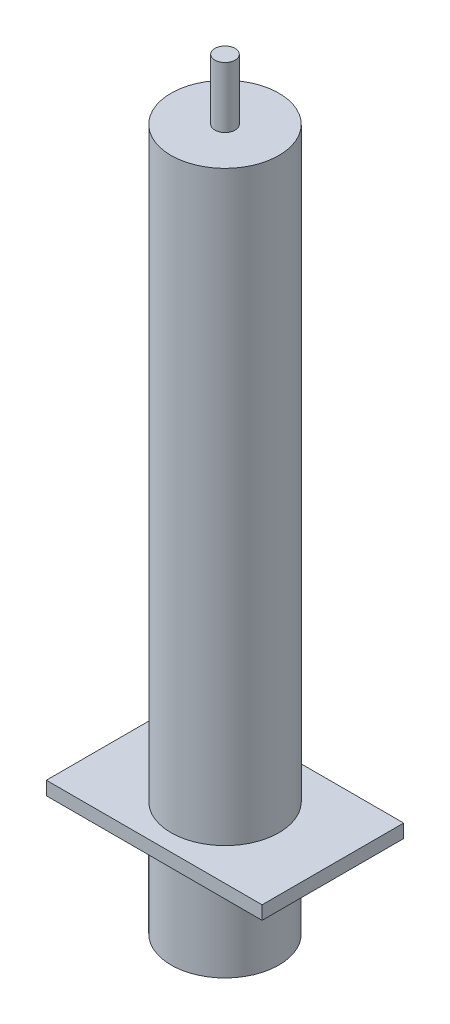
ISO-10303-21;
HEADER;
FILE_DESCRIPTION(('STEP AP214'),'2;1');
FILE_NAME('part.step','',(''),(''),'','','');
FILE_SCHEMA(('AUTOMOTIVE_DESIGN { 1 0 10303 214 1 1 1 1 }'));
ENDSEC;
DATA;
#1=APPLICATION_CONTEXT('core data for automotive mechanical design processes');
#2=APPLICATION_PROTOCOL_DEFINITION('international standard','automotive_design',2000,#1);
#3=PRODUCT_CONTEXT('',#1,'mechanical');
#4=PRODUCT('Part','Part','',(#3));
#5=PRODUCT_RELATED_PRODUCT_CATEGORY('part','',(#4));
#6=PRODUCT_DEFINITION_FORMATION('','',#4);
#7=PRODUCT_DEFINITION_CONTEXT('part definition',#1,'design');
#8=PRODUCT_DEFINITION('design','',#6,#7);
#9=PRODUCT_DEFINITION_SHAPE('','',#8);
#10=(LENGTH_UNIT() NAMED_UNIT(*) SI_UNIT(.MILLI.,.METRE.));
#11=(NAMED_UNIT(*) PLANE_ANGLE_UNIT() SI_UNIT($,.RADIAN.));
#12=(NAMED_UNIT(*) SI_UNIT($,.STERADIAN.) SOLID_ANGLE_UNIT());
#13=UNCERTAINTY_MEASURE_WITH_UNIT(LENGTH_MEASURE(1.E-05),#10,'distance_accuracy_value','');
#14=(GEOMETRIC_REPRESENTATION_CONTEXT(3) GLOBAL_UNCERTAINTY_ASSIGNED_CONTEXT((#13)) GLOBAL_UNIT_ASSIGNED_CONTEXT((#10,
#11,#12)) REPRESENTATION_CONTEXT('',''));
#15=CARTESIAN_POINT('',(0.,0.,0.));
#16=DIRECTION('',(0.,0.,1.));
#17=DIRECTION('',(1.,0.,0.));
#18=AXIS2_PLACEMENT_3D('',#15,#16,#17);
#19=CARTESIAN_POINT('',(0.,75.,0.));
#20=DIRECTION('',(0.,-1.,0.));
#21=DIRECTION('',(0.,0.,-1.));
#22=AXIS2_PLACEMENT_3D('',#19,#20,#21);
#23=CYLINDRICAL_SURFACE('',#22,8.);
#24=CARTESIAN_POINT('',(0.,0.,0.));
#25=DIRECTION('',(0.,1.,0.));
#26=DIRECTION('',(0.,0.,1.));
#27=AXIS2_PLACEMENT_3D('',#24,#25,#26);
#28=CIRCLE('',#27,8.);
#29=CARTESIAN_POINT('',(0.,0.,8.));
#30=VERTEX_POINT('',#29);
#31=EDGE_CURVE('E44',#30,#30,#28,.T.);
#32=ORIENTED_EDGE('',*,*,#31,.T.);
#33=EDGE_LOOP('',(#32));
#34=FACE_BOUND('',#33,.T.);
#35=CARTESIAN_POINT('',(0.,87.,0.));
#36=DIRECTION('',(0.,1.,0.));
#37=DIRECTION('',(0.,0.,1.));
#38=AXIS2_PLACEMENT_3D('',#35,#36,#37);
#39=CIRCLE('',#38,8.);
#40=CARTESIAN_POINT('',(0.,87.,8.));
#41=VERTEX_POINT('',#40);
#42=EDGE_CURVE('E128',#41,#41,#39,.T.);
#43=ORIENTED_EDGE('',*,*,#42,.F.);
#44=EDGE_LOOP('',(#43));
#45=FACE_BOUND('',#44,.T.);
#46=ADVANCED_FACE('F41',(#34,#45),#23,.T.);
#47=CARTESIAN_POINT('',(16.,-2.,-10.5));
#48=DIRECTION('',(-1.,0.,0.));
#49=DIRECTION('',(0.,0.,1.));
#50=AXIS2_PLACEMENT_3D('',#47,#48,#49);
#51=PLANE('',#50);
#52=DIRECTION('',(0.,0.,1.));
#53=VECTOR('',#52,1.);
#54=CARTESIAN_POINT('',(16.,0.,-10.5));
#55=LINE('',#54,#53);
#56=CARTESIAN_POINT('',(16.,0.,-10.5));
#57=VERTEX_POINT('',#56);
#58=CARTESIAN_POINT('',(16.,0.,10.5));
#59=VERTEX_POINT('',#58);
#60=EDGE_CURVE('E110',#57,#59,#55,.T.);
#61=ORIENTED_EDGE('',*,*,#60,.T.);
#62=DIRECTION('',(0.,1.,0.));
#63=VECTOR('',#62,1.);
#64=CARTESIAN_POINT('',(16.,-2.,10.5));
#65=LINE('',#64,#63);
#66=CARTESIAN_POINT('',(16.,-2.,10.5));
#67=VERTEX_POINT('',#66);
#68=EDGE_CURVE('E101',#67,#59,#65,.T.);
#69=ORIENTED_EDGE('',*,*,#68,.F.);
#70=DIRECTION('',(0.,0.,1.));
#71=VECTOR('',#70,1.);
#72=CARTESIAN_POINT('',(16.,-2.,-10.5));
#73=LINE('',#72,#71);
#74=CARTESIAN_POINT('',(16.,-2.,-10.5));
#75=VERTEX_POINT('',#74);
#76=EDGE_CURVE('E95',#75,#67,#73,.T.);
#77=ORIENTED_EDGE('',*,*,#76,.F.);
#78=DIRECTION('',(0.,1.,0.));
#79=VECTOR('',#78,1.);
#80=CARTESIAN_POINT('',(16.,-2.,-10.5));
#81=LINE('',#80,#79);
#82=EDGE_CURVE('E106',#75,#57,#81,.T.);
#83=ORIENTED_EDGE('',*,*,#82,.T.);
#84=EDGE_LOOP('',(#61,#69,#77,#83));
#85=FACE_BOUND('',#84,.T.);
#86=ADVANCED_FACE('F151',(#85),#51,.F.);
#87=CARTESIAN_POINT('',(-16.,-2.,10.5));
#88=DIRECTION('',(0.,0.,-1.));
#89=DIRECTION('',(-1.,0.,0.));
#90=AXIS2_PLACEMENT_3D('',#87,#88,#89);
#91=PLANE('',#90);
#92=DIRECTION('',(-1.,0.,0.));
#93=VECTOR('',#92,1.);
#94=CARTESIAN_POINT('',(-16.,0.,10.5));
#95=LINE('',#94,#93);
#96=CARTESIAN_POINT('',(-16.,0.,10.5));
#97=VERTEX_POINT('',#96);
#98=EDGE_CURVE('E100',#59,#97,#95,.T.);
#99=ORIENTED_EDGE('',*,*,#98,.T.);
#100=DIRECTION('',(0.,1.,0.));
#101=VECTOR('',#100,1.);
#102=CARTESIAN_POINT('',(-16.,-2.,10.5));
#103=LINE('',#102,#101);
#104=CARTESIAN_POINT('',(-16.,-2.,10.5));
#105=VERTEX_POINT('',#104);
#106=EDGE_CURVE('E98',#105,#97,#103,.T.);
#107=ORIENTED_EDGE('',*,*,#106,.F.);
#108=DIRECTION('',(-1.,0.,0.));
#109=VECTOR('',#108,1.);
#110=CARTESIAN_POINT('',(-16.,-2.,10.5));
#111=LINE('',#110,#109);
#112=EDGE_CURVE('E90',#67,#105,#111,.T.);
#113=ORIENTED_EDGE('',*,*,#112,.F.);
#114=ORIENTED_EDGE('',*,*,#68,.T.);
#115=EDGE_LOOP('',(#99,#107,#113,#114));
#116=FACE_BOUND('',#115,.T.);
#117=ADVANCED_FACE('F99',(#116),#91,.F.);
#118=CARTESIAN_POINT('',(-16.,-2.,-10.5));
#119=DIRECTION('',(1.,0.,0.));
#120=DIRECTION('',(0.,0.,-1.));
#121=AXIS2_PLACEMENT_3D('',#118,#119,#120);
#122=PLANE('',#121);
#123=DIRECTION('',(0.,0.,-1.));
#124=VECTOR('',#123,1.);
#125=CARTESIAN_POINT('',(-16.,0.,-10.5));
#126=LINE('',#125,#124);
#127=CARTESIAN_POINT('',(-16.,0.,-10.5));
#128=VERTEX_POINT('',#127);
#129=EDGE_CURVE('E76',#97,#128,#126,.T.);
#130=ORIENTED_EDGE('',*,*,#129,.T.);
#131=DIRECTION('',(0.,1.,0.));
#132=VECTOR('',#131,1.);
#133=CARTESIAN_POINT('',(-16.,-2.,-10.5));
#134=LINE('',#133,#132);
#135=CARTESIAN_POINT('',(-16.,-2.,-10.5));
#136=VERTEX_POINT('',#135);
#137=EDGE_CURVE('E102',#136,#128,#134,.T.);
#138=ORIENTED_EDGE('',*,*,#137,.F.);
#139=DIRECTION('',(0.,0.,-1.));
#140=VECTOR('',#139,1.);
#141=CARTESIAN_POINT('',(-16.,-2.,-10.5));
#142=LINE('',#141,#140);
#143=EDGE_CURVE('E93',#105,#136,#142,.T.);
#144=ORIENTED_EDGE('',*,*,#143,.F.);
#145=ORIENTED_EDGE('',*,*,#106,.T.);
#146=EDGE_LOOP('',(#130,#138,#144,#145));
#147=FACE_BOUND('',#146,.T.);
#148=ADVANCED_FACE('F104',(#147),#122,.F.);
#149=CARTESIAN_POINT('',(-16.,-2.,-10.5));
#150=DIRECTION('',(0.,0.,1.));
#151=DIRECTION('',(1.,0.,0.));
#152=AXIS2_PLACEMENT_3D('',#149,#150,#151);
#153=PLANE('',#152);
#154=DIRECTION('',(1.,0.,0.));
#155=VECTOR('',#154,1.);
#156=CARTESIAN_POINT('',(-16.,0.,-10.5));
#157=LINE('',#156,#155);
#158=EDGE_CURVE('E82',#128,#57,#157,.T.);
#159=ORIENTED_EDGE('',*,*,#158,.T.);
#160=ORIENTED_EDGE('',*,*,#82,.F.);
#161=DIRECTION('',(1.,0.,0.));
#162=VECTOR('',#161,1.);
#163=CARTESIAN_POINT('',(-16.,-2.,-10.5));
#164=LINE('',#163,#162);
#165=EDGE_CURVE('E59',#136,#75,#164,.T.);
#166=ORIENTED_EDGE('',*,*,#165,.F.);
#167=ORIENTED_EDGE('',*,*,#137,.T.);
#168=EDGE_LOOP('',(#159,#160,#166,#167));
#169=FACE_BOUND('',#168,.T.);
#170=ADVANCED_FACE('F164',(#169),#153,.F.);
#171=CARTESIAN_POINT('',(0.,-2.,0.));
#172=DIRECTION('',(0.,1.,0.));
#173=DIRECTION('',(0.,0.,1.));
#174=AXIS2_PLACEMENT_3D('',#171,#172,#173);
#175=PLANE('',#174);
#176=CARTESIAN_POINT('',(0.,-2.,0.));
#177=DIRECTION('',(0.,-1.,0.));
#178=DIRECTION('',(0.,0.,-1.));
#179=AXIS2_PLACEMENT_3D('',#176,#177,#178);
#180=CIRCLE('',#179,8.);
#181=CARTESIAN_POINT('',(0.,-2.,-8.));
#182=VERTEX_POINT('',#181);
#183=EDGE_CURVE('E50',#182,#182,#180,.T.);
#184=ORIENTED_EDGE('',*,*,#183,.F.);
#185=EDGE_LOOP('',(#184));
#186=FACE_BOUND('',#185,.T.);
#187=ORIENTED_EDGE('',*,*,#76,.T.);
#188=ORIENTED_EDGE('',*,*,#112,.T.);
#189=ORIENTED_EDGE('',*,*,#143,.T.);
#190=ORIENTED_EDGE('',*,*,#165,.T.);
#191=EDGE_LOOP('',(#187,#188,#189,#190));
#192=FACE_BOUND('',#191,.T.);
#193=ADVANCED_FACE('F91',(#186,#192),#175,.F.);
#194=CARTESIAN_POINT('',(0.,0.,0.));
#195=DIRECTION('',(0.,1.,0.));
#196=DIRECTION('',(0.,0.,1.));
#197=AXIS2_PLACEMENT_3D('',#194,#195,#196);
#198=PLANE('',#197);
#199=ORIENTED_EDGE('',*,*,#31,.F.);
#200=EDGE_LOOP('',(#199));
#201=FACE_BOUND('',#200,.T.);
#202=ORIENTED_EDGE('',*,*,#60,.F.);
#203=ORIENTED_EDGE('',*,*,#158,.F.);
#204=ORIENTED_EDGE('',*,*,#129,.F.);
#205=ORIENTED_EDGE('',*,*,#98,.F.);
#206=EDGE_LOOP('',(#202,#203,#204,#205));
#207=FACE_BOUND('',#206,.T.);
#208=ADVANCED_FACE('F167',(#201,#207),#198,.T.);
#209=CARTESIAN_POINT('',(0.,-17.,0.));
#210=DIRECTION('',(0.,1.,0.));
#211=DIRECTION('',(0.,0.,1.));
#212=AXIS2_PLACEMENT_3D('',#209,#210,#211);
#213=CYLINDRICAL_SURFACE('',#212,8.);
#214=CARTESIAN_POINT('',(0.,-17.,0.));
#215=DIRECTION('',(0.,-1.,0.));
#216=DIRECTION('',(0.,0.,-1.));
#217=AXIS2_PLACEMENT_3D('',#214,#215,#216);
#218=CIRCLE('',#217,8.);
#219=CARTESIAN_POINT('',(0.,-17.,-8.));
#220=VERTEX_POINT('',#219);
#221=EDGE_CURVE('E113',#220,#220,#218,.T.);
#222=ORIENTED_EDGE('',*,*,#221,.F.);
#223=EDGE_LOOP('',(#222));
#224=FACE_BOUND('',#223,.T.);
#225=ORIENTED_EDGE('',*,*,#183,.T.);
#226=EDGE_LOOP('',(#225));
#227=FACE_BOUND('',#226,.T.);
#228=ADVANCED_FACE('F170',(#224,#227),#213,.T.);
#229=CARTESIAN_POINT('',(0.,-17.,0.));
#230=DIRECTION('',(0.,-1.,0.));
#231=DIRECTION('',(0.,0.,-1.));
#232=AXIS2_PLACEMENT_3D('',#229,#230,#231);
#233=PLANE('',#232);
#234=ORIENTED_EDGE('',*,*,#221,.T.);
#235=EDGE_LOOP('',(#234));
#236=FACE_BOUND('',#235,.T.);
#237=ADVANCED_FACE('F146',(#236),#233,.T.);
#238=CARTESIAN_POINT('',(0.,87.,0.));
#239=DIRECTION('',(0.,1.,0.));
#240=DIRECTION('',(0.,0.,1.));
#241=AXIS2_PLACEMENT_3D('',#238,#239,#240);
#242=PLANE('',#241);
#243=CARTESIAN_POINT('',(0.,87.,0.));
#244=DIRECTION('',(0.,1.,0.));
#245=DIRECTION('',(0.,0.,1.));
#246=AXIS2_PLACEMENT_3D('',#243,#244,#245);
#247=CIRCLE('',#246,1.5);
#248=CARTESIAN_POINT('',(0.,87.,1.5));
#249=VERTEX_POINT('',#248);
#250=EDGE_CURVE('E11',#249,#249,#247,.T.);
#251=ORIENTED_EDGE('',*,*,#250,.F.);
#252=EDGE_LOOP('',(#251));
#253=FACE_BOUND('',#252,.T.);
#254=ORIENTED_EDGE('',*,*,#42,.T.);
#255=EDGE_LOOP('',(#254));
#256=FACE_BOUND('',#255,.T.);
#257=ADVANCED_FACE('F140',(#253,#256),#242,.T.);
#258=CARTESIAN_POINT('',(0.,96.,0.));
#259=DIRECTION('',(0.,-1.,0.));
#260=DIRECTION('',(0.,0.,-1.));
#261=AXIS2_PLACEMENT_3D('',#258,#259,#260);
#262=CYLINDRICAL_SURFACE('',#261,1.5);
#263=CARTESIAN_POINT('',(0.,96.,0.));
#264=DIRECTION('',(0.,1.,0.));
#265=DIRECTION('',(0.,0.,1.));
#266=AXIS2_PLACEMENT_3D('',#263,#264,#265);
#267=CIRCLE('',#266,1.5);
#268=CARTESIAN_POINT('',(0.,96.,1.5));
#269=VERTEX_POINT('',#268);
#270=EDGE_CURVE('E130',#269,#269,#267,.T.);
#271=ORIENTED_EDGE('',*,*,#270,.F.);
#272=EDGE_LOOP('',(#271));
#273=FACE_BOUND('',#272,.T.);
#274=ORIENTED_EDGE('',*,*,#250,.T.);
#275=EDGE_LOOP('',(#274));
#276=FACE_BOUND('',#275,.T.);
#277=ADVANCED_FACE('F137',(#273,#276),#262,.T.);
#278=CARTESIAN_POINT('',(0.,96.,0.));
#279=DIRECTION('',(0.,1.,0.));
#280=DIRECTION('',(0.,0.,1.));
#281=AXIS2_PLACEMENT_3D('',#278,#279,#280);
#282=PLANE('',#281);
#283=ORIENTED_EDGE('',*,*,#270,.T.);
#284=EDGE_LOOP('',(#283));
#285=FACE_BOUND('',#284,.T.);
#286=ADVANCED_FACE('F135',(#285),#282,.T.);
#287=CLOSED_SHELL('',(#46,#86,#117,#148,#170,#193,#208,#228,#237,#257,#277,#286));
#288=MANIFOLD_SOLID_BREP('B2',#287);
#289=ADVANCED_BREP_SHAPE_REPRESENTATION('',(#18,#288),#14);
#290=SHAPE_DEFINITION_REPRESENTATION(#9,#289);
ENDSEC;
END-ISO-10303-21;
